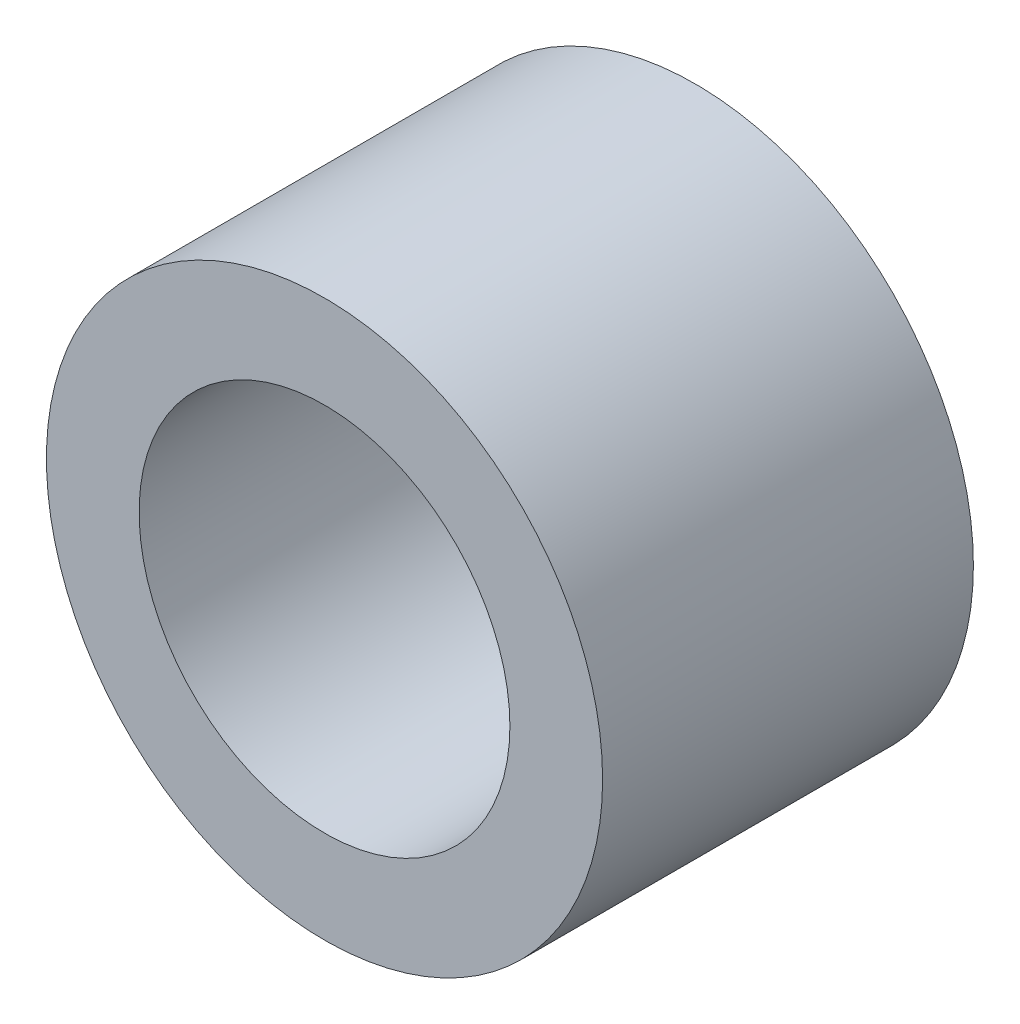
from build123d import *

# Parameters (mm, degrees)
ESQUISSE1_R      = 3
ESQUISSE1_R_2    = 2
EXTRUSION1_DEPTH = 4


with BuildPart() as part:
    # Esquisse1 → Extrusion1 (new body)
    with BuildSketch(Plane.XY):
        Circle(ESQUISSE1_R)
        Circle(ESQUISSE1_R_2, mode=Mode.SUBTRACT)
    extrude(amount=EXTRUSION1_DEPTH)


solid = part.part
